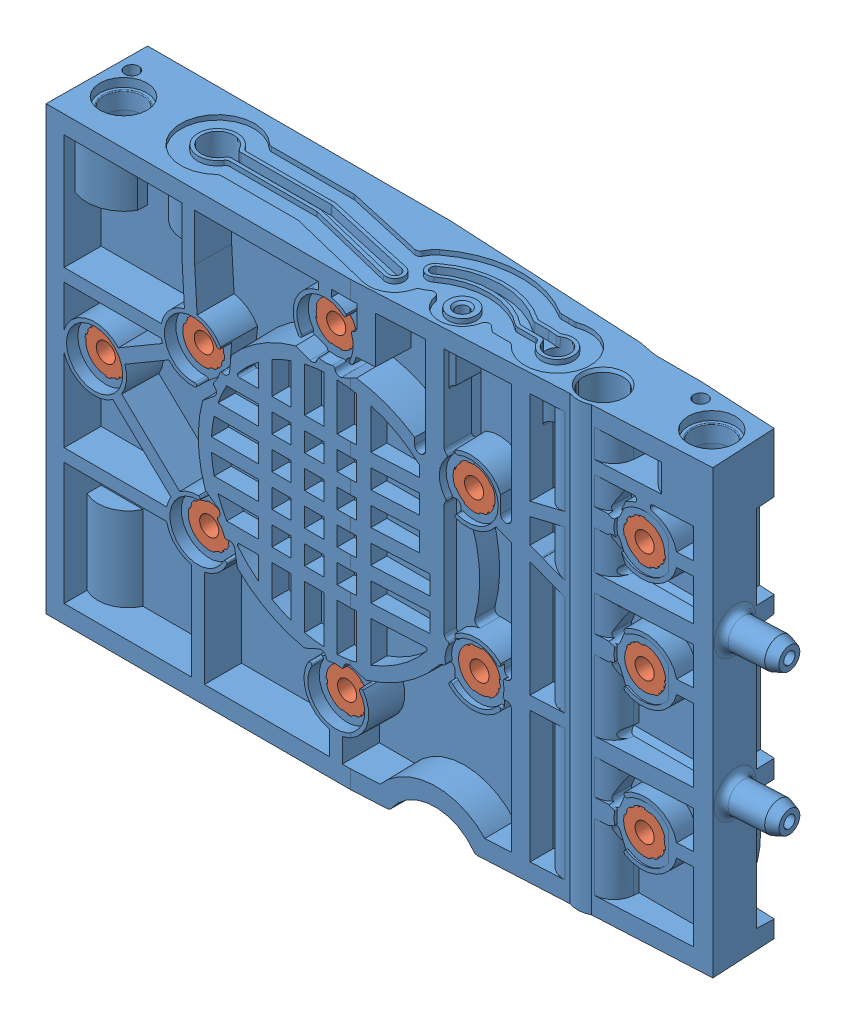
SolidWorks assembly 020101_AR_cartridge_bottom_inserts.SLDASM, configuration Default (file format 15000). Lengths in mm.
Overall size (236.56 99.65 14.01).
11 component instances, 2 part files, 20 mates.
Components (placement in the parent):
- 020101-1_AR_cartridge_bottom-1: 020101-1_AR_cartridge_bottom.SLDPRT [0.5] at origin size (236.56 99.65 14.01)
- 019901_insert_M2.5-1: 019901_insert_M2.5.SLDPRT [Default] at (29.9154 -58.2602 4.2) x (0 0 1) z (-0.923728 -0.383049 0) size (3.5 4.5 4.5)
- 019901_insert_M2.5-2: 019901_insert_M2.5.SLDPRT [Default] at (45.2894 -82.8636 4.2) x (0 0 1) z (-0.85131 -0.524663 0) size (3.5 4.5 4.5)
- 019901_insert_M2.5-3: 019901_insert_M2.5.SLDPRT [Default] at (15.7106 -67.1364 4.2) x (0 0 1) z (-0.777574 -0.628792 0) size (3.5 4.5 4.5)
- 019901_insert_M2.5-4: 019901_insert_M2.5.SLDPRT [Default] at (16.2952 -83.8761 4.2) x (0 0 1) z (-0.715577 -0.698533 0) size (3.5 4.5 4.5)
- 019901_insert_M2.5-7: 019901_insert_M2.5.SLDPRT [Default] at (31.0846 -91.7398 4.2) x (0 0 1) z (-0.699005 -0.715117 0) size (3.5 4.5 4.5)
- 019901_insert_M2.5-14: 019901_insert_M2.5.SLDPRT [Default] at (62.5 -74.3 3.7) x (0 0 1) z (-0.516226 0.856452 0) size (3.5 4.5 4.5)
- 019901_insert_M2.5-19: 019901_insert_M2.5.SLDPRT [Default] at (44.7048 -66.1239 4.2) x (0 0 1) z (-0.797228 0.603678 0) size (3.5 4.5 4.5)
- 019901_insert_M2.5-22: 019901_insert_M2.5.SLDPRT [Default] at (62.5 -89.5 3.7) x (0 0 1) z (-0.898458 0.439059 0) size (3.5 4.5 4.5)
- 019901_insert_M2.5-23: 019901_insert_M2.5.SLDPRT [Default] at (62.5 -62.5 3.7) x (0 0 1) z (-0.645489 0.763769 0) size (3.5 4.5 4.5)
- 019901_insert_M2.5-25: 019901_insert_M2.5.SLDPRT [Default] at (5.2 -73.3 4.2) x (0 0 1) z (-0.737487 0.675361 0) size (3.5 4.5 4.5)
Mates (geometry in assembly coordinates):
- Concentric1: concentric anti-aligned: cylinder of 019901_insert_IUC-M2.5-1-1 through (29.9154 -58.2602 -104.8615) axis (0 0 -1) radius 2.25; circle of 020101-1_AR_cartridge_bottom-1
- Coincident1: coincident aligned: plane of 020101-1_AR_cartridge_bottom-1 through (31.2654 -58.2602 4.2) normal (0 0 1); plane of 019901_insert_IUC-M2.5-1-1 through (30.7773 -60.3386 4.2) normal (0 0 1)
- Concentric2: concentric anti-aligned: cylinder of 019901_insert_IUC-M2.5-1-2 through (45.2894 -82.8636 -104.8615) axis (0 0 -1) radius 2.25; circle of LnG5_cartridge-1
- Coincident2: coincident aligned: plane of 020101-1_AR_cartridge_bottom-1 through (46.6394 -82.8636 4.2) normal (0 0 1); plane of 019901_insert_IUC-M2.5-1-2 through (46.4699 -84.7791 4.2) normal (0 0 1)
- Coincident3: coincident aligned: plane of 020101-1_AR_cartridge_bottom-1 through (17.0606 -67.1364 4.2) normal (0 0 1); plane of 019901_insert_IUC-M2.5-1-3 through (17.1254 -68.8859 4.2) normal (0 0 1)
- Concentric4: concentric aligned: cylinder of 019901_insert_IUC-M2.5-1-3 through (15.7106 -67.1364 -104.8615) axis (0 0 -1) radius 2.25; cone of 020101-1_AR_cartridge_bottom-1 through (15.7106 -67.1364 4.2) axis (0 0 -1)
- Coincident4: coincident aligned: plane of 020101-1_AR_cartridge_bottom-1 through (17.6452 -83.8761 4.2) normal (0 0 1); plane of 019901_insert_IUC-M2.5-1-4 through (17.8669 -85.4862 4.2) normal (0 0 1)
- Concentric5: concentric anti-aligned: cylinder of 019901_insert_IUC-M2.5-1-4 through (16.2952 -83.8761 -104.8615) axis (0 0 -1) radius 2.25; circle of LnG5_cartridge-1
- Coincident7: coincident aligned: plane of 020101-1_AR_cartridge_bottom-1 through (32.4346 -91.7398 4.2) normal (0 0 1); plane of 019901_insert_IUC-M2.5-1-7 through (32.6936 -93.3126 4.2) normal (0 0 1)
- Concentric8: concentric anti-aligned: cylinder of 019901_insert_IUC-M2.5-1-7 through (31.0846 -91.7398 -104.8615) axis (0 0 -1) radius 2.25; circle of LnG5_cartridge-1
- Coincident12: coincident aligned: plane of 020101-1_AR_cartridge_bottom-1 through (63.85 -74.3 3.7) normal (0 0 1); plane of 019901_insert_IUC-M2.5-1-14 through (60.573 -75.4615 3.7) normal (0 0 1)
- Concentric11: concentric aligned: cone of 020101-1_AR_cartridge_bottom-1 through (62.5 -74.3 3.7) axis (0 0 -1); cylinder of 019901_insert_IUC-M2.5-1-14 through (62.5 -74.3 -105.3615) axis (0 0 -1) radius 2.25
- Coincident15: coincident aligned: plane of 020101-1_AR_cartridge_bottom-1 through (46.0548 -66.1239 4.2) normal (0 0 1); plane of 019901_insert_IUC-M2.5-1-19 through (43.3465 -67.9176 4.2) normal (0 0 1)
- Concentric15: concentric aligned: cone of 020101-1_AR_cartridge_bottom-1 through (44.7048 -66.1239 4.2) axis (0 0 -1); cylinder of 019901_insert_IUC-M2.5-1-19 through (44.7048 -66.1239 -104.8615) axis (0 0 -1) radius 2.25
- Coincident17: coincident aligned: plane of 020101-1_AR_cartridge_bottom-1 through (63.85 -89.5 3.7) normal (0 0 1); plane of 019901_insert_IUC-M2.5-1-22 through (61.5121 -91.5215 3.7) normal (0 0 1)
- Concentric17: concentric aligned: cone of 020101-1_AR_cartridge_bottom-1 through (62.5 -89.5 3.7) axis (0 0 -1); cylinder of 019901_insert_IUC-M2.5-1-22 through (62.5 -89.5 -105.3615) axis (0 0 -1) radius 2.25
- Coincident18: coincident aligned: plane of 020101-1_AR_cartridge_bottom-1 through (63.85 -62.5 3.7) normal (0 0 1); plane of 019901_insert_IUC-M2.5-1-23 through (60.7815 -63.9524 3.7) normal (0 0 1)
- Concentric18: concentric aligned: cone of 020101-1_AR_cartridge_bottom-1 through (62.5 -62.5 3.7) axis (0 0 -1); cylinder of 019901_insert_IUC-M2.5-1-23 through (62.5 -62.5 -105.3615) axis (0 0 -1) radius 2.25
- Coincident19: coincident aligned: plane of 020101-1_AR_cartridge_bottom-1 through (6.55 -73.3 4.2) normal (0 0 1); plane of 019901_insert_IUC-M2.5-1-25 through (3.6804 -74.9593 4.2) normal (0 0 1)
- Concentric19: concentric aligned: cone of 020101-1_AR_cartridge_bottom-1 through (5.2 -73.3 3.7) axis (0 0 -1); cylinder of 019901_insert_IUC-M2.5-1-25 through (5.2 -73.3 -104.8615) axis (0 0 -1) radius 2.25
